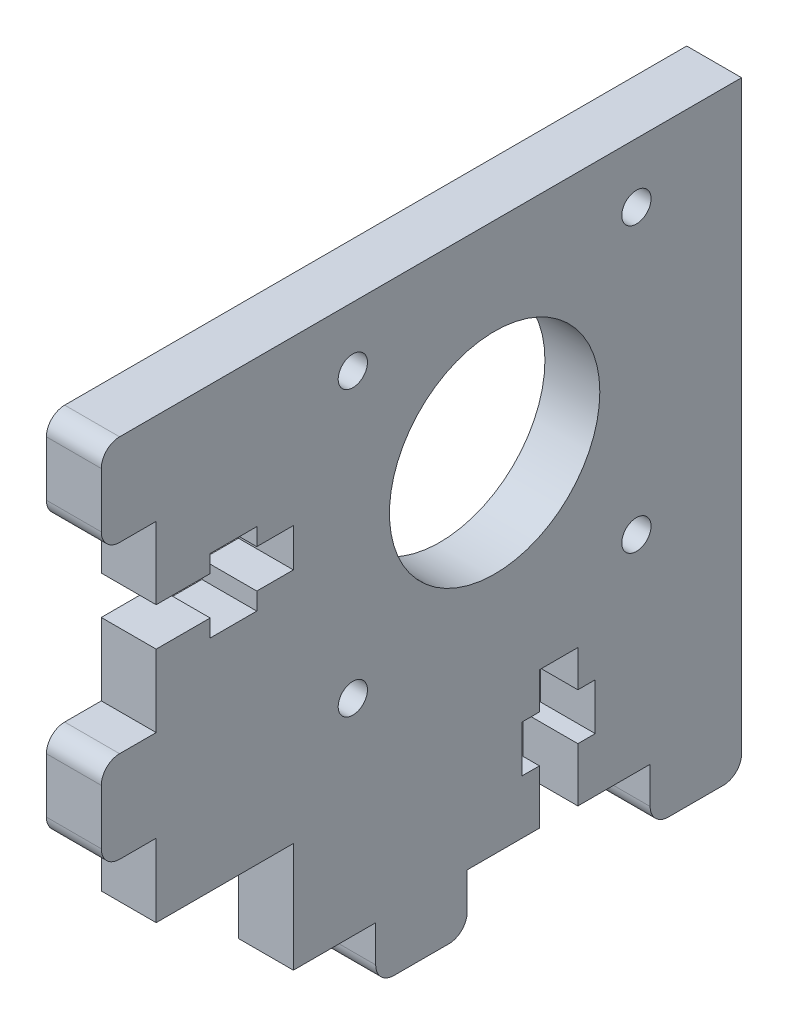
from build123d import *

# Parameters (mm, degrees)
SKETCH_1_R          = 1.6
SKETCH_1_R_2        = 11.5
EXTRUDE_1_DEPTH     = 6
SKETCH_2_W          = 15
SKETCH_2_H          = 12
CUT_EXTRUDE_1_DEPTH = 88.931791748


with BuildPart() as part:
    # Sketch 1 → Extrude 1 (new body)
    # profile 1 of 5: a face of its own
    with BuildSketch(Plane(origin=(0, 0, 0), x_dir=(0, 0, -1), z_dir=(1, 0, 0))):
        with BuildLine():
            Line((-4, 50), (0, 50))
            Line((0, 50), (0, 60))
            Line((0, 60), (-4, 60))
            ThreePointArc((-4, 60), (-5.414213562, 59.414213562), (-6, 58))
            Line((-6, 58), (-6, 52))
            ThreePointArc((-6, 52), (-5.414213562, 50.585786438), (-4, 50))
        make_face()
    # profile 2 of 5: a face of its own
    with BuildSketch(Plane(origin=(0, 0, 0), x_dir=(0, 0, -1), z_dir=(1, 0, 0))):
        with BuildLine():
            Line((-4, 20), (0, 20))
            Line((0, 20), (0, 30))
            Line((0, 30), (-4, 30))
            ThreePointArc((-4, 30), (-5.414213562, 29.414213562), (-6, 28))
            Line((-6, 28), (-6, 22))
            ThreePointArc((-6, 22), (-5.414213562, 20.585786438), (-4, 20))
        make_face()
    # profile 3 of 5: a face of its own
    with BuildSketch(Plane(origin=(0, 0, 0), x_dir=(0, 0, -1), z_dir=(1, 0, 0))):
        with BuildLine():
            Line((34, 0), (24, 0))
            Line((24, 0), (24, -4))
            ThreePointArc((24, -4), (24.585786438, -5.414213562), (26, -6))
            Line((26, -6), (32, -6))
            ThreePointArc((32, -6), (33.414213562, -5.414213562), (34, -4))
            Line((34, -4), (34, 0))
        make_face()
    # profile 4 of 5: a face of its own
    with BuildSketch(Plane(origin=(0, 0, 0), x_dir=(0, 0, -1), z_dir=(1, 0, 0))):
        with BuildLine():
            Line((64, 0), (54, 0))
            Line((54, 0), (54, -4))
            ThreePointArc((54, -4), (54.585786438, -5.414213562), (56, -6))
            Line((56, -6), (62, -6))
            ThreePointArc((62, -6), (63.414213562, -5.414213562), (64, -4))
            Line((64, -4), (64, 0))
        make_face()
    # profile 5 of 5: a face of its own
    with BuildSketch(Plane(origin=(0, 0, 0), x_dir=(0, 0, -1), z_dir=(1, 0, 0))):
        Polygon((0, 20), (0, 0), (24, 0), (34, 0), (41.9, 0), (41.9, 5.9), (40, 5.9), (40, 11), (41.9, 11), (41.9, 15), (46.1, 15), (46.1, 11), (48, 11), (48, 5.9), (46.1, 5.9), (46.1, 0), (54, 0), (64, 0), (64, 60), (0, 60), (0, 50), (0, 42.1), (5.9, 42.1), (5.9, 44), (11, 44), (11, 42.1), (15, 42.1), (15, 37.9), (11, 37.9), (11, 36), (5.9, 36), (5.9, 37.9), (0, 37.9), (0, 30), align=None)
        with Locations((21.5, 22.5)):
            Circle(SKETCH_1_R, mode=Mode.SUBTRACT)
        with Locations((52.5, 22.5)):
            Circle(SKETCH_1_R, mode=Mode.SUBTRACT)
        with Locations((21.5, 53.5)):
            Circle(SKETCH_1_R, mode=Mode.SUBTRACT)
        with Locations((37, 38)):
            Circle(SKETCH_1_R_2, mode=Mode.SUBTRACT)
        with Locations((52.5, 53.5)):
            Circle(SKETCH_1_R, mode=Mode.SUBTRACT)
    extrude(amount=EXTRUDE_1_DEPTH)

    # Sketch 2 → Cut-Extrude 1 (cut, through all)
    with BuildSketch(Plane(origin=(6, 0, 0), x_dir=(0, 0, -1), z_dir=(1, 0, 0))):
        with Locations((7.5, 6)):
            Rectangle(SKETCH_2_W, SKETCH_2_H)
    extrude(amount=-CUT_EXTRUDE_1_DEPTH, mode=Mode.SUBTRACT)


solid = part.part
